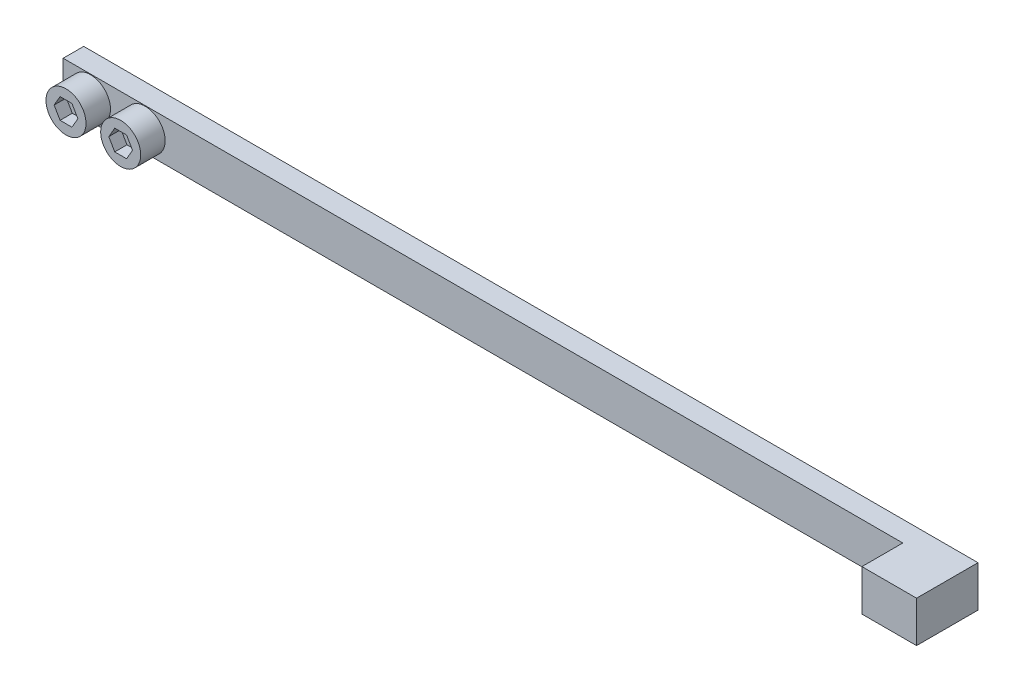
from build123d import *

# Parameters (mm, degrees)
EXTRUDE1_DEPTH     = 4.7752
SKETCH2_R          = 2.3241
EXTRUDE2_DEPTH     = 2.8448
CUT_EXTRUDE1_DEPTH = 1.4224


with BuildPart() as part:
    # Sketch1 → Extrude1 (new body)
    with BuildSketch(Plane(origin=(0, -2.3876, 0), x_dir=(-1, 0, 0), z_dir=(0, 1, 0))):
        Polygon((63.8048, -1.1938), (63.8048, 1.1938), (-33.7312, 1.1938), (-33.7312, 5.9436), (-40.0812, 5.9436), (-40.0812, -1.1938), align=None)
    extrude(amount=EXTRUDE1_DEPTH)

    # Sketch2 → Extrude2 (add)
    with BuildSketch(Plane.XY.offset(1.1938)):
        with Locations(Location((-60.6298, 0, 0), (0, 0, 180))):
            Circle(SKETCH2_R)
        with Locations(Location((-54.2798, 0, 0), (0, 0, 180))):
            Circle(SKETCH2_R)
    extrude(amount=EXTRUDE2_DEPTH)

    # Sketch3 → Cut-Extrude1 (cut)
    with BuildSketch(Plane.XY.offset(4.0386)):
        Polygon((-61.319040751, 1.1938), (-62.008281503, 0), (-61.319040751, -1.1938), (-59.940559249, -1.1938), (-59.251318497, 0), (-59.940559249, 1.1938), align=None)
        Polygon((-55.658281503, 0), (-54.969040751, -1.1938), (-53.590559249, -1.1938), (-52.901318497, 0), (-53.590559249, 1.1938), (-54.969040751, 1.1938), align=None)
    extrude(amount=-CUT_EXTRUDE1_DEPTH, mode=Mode.SUBTRACT)


solid = part.part
